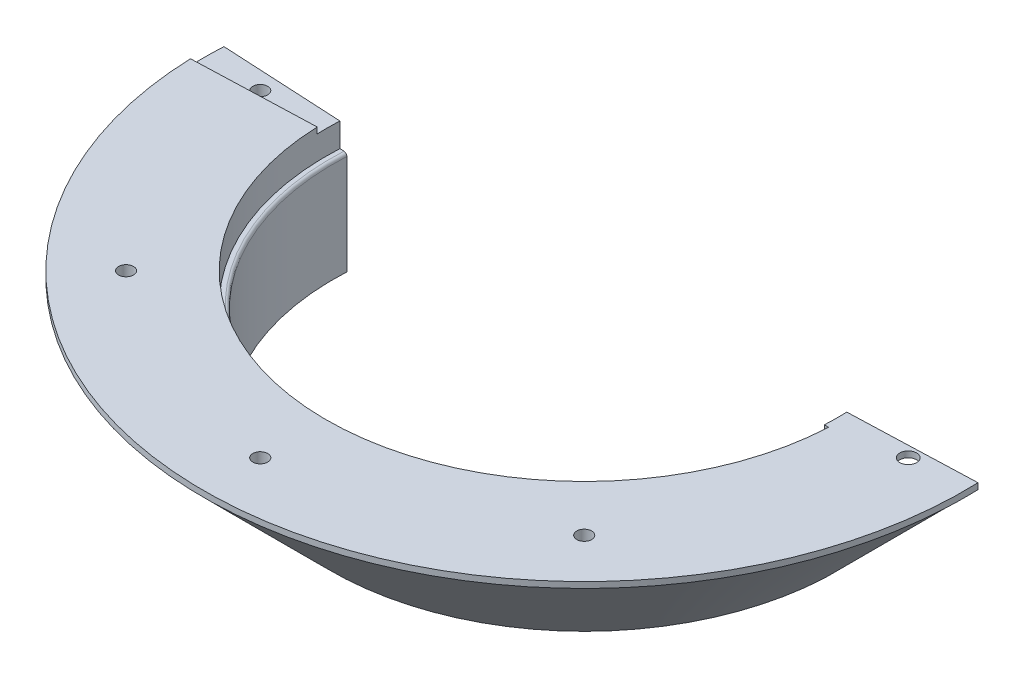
ISO-10303-21;
HEADER;
FILE_DESCRIPTION(('STEP AP214'),'2;1');
FILE_NAME('part.step','',(''),(''),'','','');
FILE_SCHEMA(('AUTOMOTIVE_DESIGN { 1 0 10303 214 1 1 1 1 }'));
ENDSEC;
DATA;
#1=APPLICATION_CONTEXT('core data for automotive mechanical design processes');
#2=APPLICATION_PROTOCOL_DEFINITION('international standard','automotive_design',2000,#1);
#3=PRODUCT_CONTEXT('',#1,'mechanical');
#4=PRODUCT('Part','Part','',(#3));
#5=PRODUCT_RELATED_PRODUCT_CATEGORY('part','',(#4));
#6=PRODUCT_DEFINITION_FORMATION('','',#4);
#7=PRODUCT_DEFINITION_CONTEXT('part definition',#1,'design');
#8=PRODUCT_DEFINITION('design','',#6,#7);
#9=PRODUCT_DEFINITION_SHAPE('','',#8);
#10=(LENGTH_UNIT() NAMED_UNIT(*) SI_UNIT(.MILLI.,.METRE.));
#11=(NAMED_UNIT(*) PLANE_ANGLE_UNIT() SI_UNIT($,.RADIAN.));
#12=(NAMED_UNIT(*) SI_UNIT($,.STERADIAN.) SOLID_ANGLE_UNIT());
#13=UNCERTAINTY_MEASURE_WITH_UNIT(LENGTH_MEASURE(1.E-05),#10,'distance_accuracy_value','');
#14=(GEOMETRIC_REPRESENTATION_CONTEXT(3) GLOBAL_UNCERTAINTY_ASSIGNED_CONTEXT((#13)) GLOBAL_UNIT_ASSIGNED_CONTEXT((#10,
#11,#12)) REPRESENTATION_CONTEXT('',''));
#15=CARTESIAN_POINT('',(0.,0.,0.));
#16=DIRECTION('',(0.,0.,1.));
#17=DIRECTION('',(1.,0.,0.));
#18=AXIS2_PLACEMENT_3D('',#15,#16,#17);
#19=CARTESIAN_POINT('',(-117.88380266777,18.796,0.));
#20=DIRECTION('',(0.,-1.,0.));
#21=DIRECTION('',(0.,0.,-1.));
#22=AXIS2_PLACEMENT_3D('',#19,#20,#21);
#23=PLANE('',#22);
#24=CARTESIAN_POINT('',(0.,18.796,0.));
#25=DIRECTION('',(0.,-1.,0.));
#26=DIRECTION('',(0.,0.,-1.));
#27=AXIS2_PLACEMENT_3D('',#24,#25,#26);
#28=CIRCLE('',#27,109.791499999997);
#29=CARTESIAN_POINT('',(109.641034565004,18.796,5.74604313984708));
#30=VERTEX_POINT('',#29);
#31=CARTESIAN_POINT('',(-109.724617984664,18.796,3.83166809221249));
#32=VERTEX_POINT('',#31);
#33=EDGE_CURVE('E192',#30,#32,#28,.T.);
#34=ORIENTED_EDGE('',*,*,#33,.T.);
#35=DIRECTION('',(0.999390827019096,0.,-0.0348994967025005));
#36=VECTOR('',#35,1.);
#37=CARTESIAN_POINT('',(-161.826359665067,18.796,5.6511010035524));
#38=LINE('',#37,#36);
#39=CARTESIAN_POINT('',(-161.826359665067,18.796,5.65110100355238));
#40=VERTEX_POINT('',#39);
#41=EDGE_CURVE('E187',#40,#32,#38,.T.);
#42=ORIENTED_EDGE('',*,*,#41,.F.);
#43=CARTESIAN_POINT('',(0.,18.796,0.));
#44=DIRECTION('',(0.,-1.,0.));
#45=DIRECTION('',(0.,0.,-1.));
#46=AXIS2_PLACEMENT_3D('',#43,#44,#45);
#47=CIRCLE('',#46,161.925);
#48=CARTESIAN_POINT('',(161.826359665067,18.796,-5.65110100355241));
#49=VERTEX_POINT('',#48);
#50=EDGE_CURVE('E180',#49,#40,#47,.T.);
#51=ORIENTED_EDGE('',*,*,#50,.F.);
#52=DIRECTION('',(-0.999390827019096,0.,0.0348994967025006));
#53=VECTOR('',#52,1.);
#54=CARTESIAN_POINT('',(107.896932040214,18.796,-3.76784389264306));
#55=LINE('',#54,#53);
#56=CARTESIAN_POINT('',(107.896932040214,18.796,-3.76784389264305));
#57=VERTEX_POINT('',#56);
#58=EDGE_CURVE('E186',#49,#57,#55,.T.);
#59=ORIENTED_EDGE('',*,*,#58,.T.);
#60=CARTESIAN_POINT('',(0.,18.796,0.));
#61=DIRECTION('',(0.,-1.,0.));
#62=DIRECTION('',(0.,0.,1.));
#63=AXIS2_PLACEMENT_3D('',#60,#61,#62);
#64=CIRCLE('',#63,107.9627);
#65=CARTESIAN_POINT('',(107.814740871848,18.796,5.65033114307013));
#66=VERTEX_POINT('',#65);
#67=EDGE_CURVE('E210',#57,#66,#64,.T.);
#68=ORIENTED_EDGE('',*,*,#67,.T.);
#69=DIRECTION('',(0.998629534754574,0.,0.0523359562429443));
#70=VECTOR('',#69,1.);
#71=CARTESIAN_POINT('',(107.814740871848,18.796,5.65033114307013));
#72=LINE('',#71,#70);
#73=EDGE_CURVE('E204',#66,#30,#72,.T.);
#74=ORIENTED_EDGE('',*,*,#73,.T.);
#75=EDGE_LOOP('',(#34,#42,#51,#59,#68,#74));
#76=FACE_BOUND('',#75,.T.);
#77=CARTESIAN_POINT('',(-97.4357789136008,18.796,97.4357789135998));
#78=DIRECTION('',(0.,1.,0.));
#79=DIRECTION('',(0.,0.,1.));
#80=AXIS2_PLACEMENT_3D('',#77,#78,#79);
#81=CIRCLE('',#80,3.175);
#82=CARTESIAN_POINT('',(-97.4357789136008,18.796,100.6107789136));
#83=VERTEX_POINT('',#82);
#84=EDGE_CURVE('E291',#83,#83,#81,.T.);
#85=ORIENTED_EDGE('',*,*,#84,.F.);
#86=EDGE_LOOP('',(#85));
#87=FACE_BOUND('',#86,.T.);
#88=CARTESIAN_POINT('',(-4.73459512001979E-13,18.796,137.795));
#89=DIRECTION('',(0.,1.,0.));
#90=DIRECTION('',(0.,0.,1.));
#91=AXIS2_PLACEMENT_3D('',#88,#89,#90);
#92=CIRCLE('',#91,3.17499999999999);
#93=CARTESIAN_POINT('',(-4.73459512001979E-13,18.796,140.97));
#94=VERTEX_POINT('',#93);
#95=EDGE_CURVE('E307',#94,#94,#92,.T.);
#96=ORIENTED_EDGE('',*,*,#95,.F.);
#97=EDGE_LOOP('',(#96));
#98=FACE_BOUND('',#97,.T.);
#99=CARTESIAN_POINT('',(97.4357789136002,18.796,97.4357789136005));
#100=DIRECTION('',(0.,1.,0.));
#101=DIRECTION('',(0.,0.,1.));
#102=AXIS2_PLACEMENT_3D('',#99,#100,#101);
#103=CIRCLE('',#102,3.175);
#104=CARTESIAN_POINT('',(97.4357789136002,18.796,100.610778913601));
#105=VERTEX_POINT('',#104);
#106=EDGE_CURVE('E323',#105,#105,#103,.T.);
#107=ORIENTED_EDGE('',*,*,#106,.F.);
#108=EDGE_LOOP('',(#107));
#109=FACE_BOUND('',#108,.T.);
#110=CARTESIAN_POINT('',(137.795,18.796,0.));
#111=DIRECTION('',(0.,1.,0.));
#112=DIRECTION('',(0.,0.,1.));
#113=AXIS2_PLACEMENT_3D('',#110,#111,#112);
#114=CIRCLE('',#113,3.57187499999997);
#115=CARTESIAN_POINT('',(137.795,18.796,3.57187499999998));
#116=VERTEX_POINT('',#115);
#117=EDGE_CURVE('E218',#116,#116,#114,.T.);
#118=ORIENTED_EDGE('',*,*,#117,.F.);
#119=EDGE_LOOP('',(#118));
#120=FACE_BOUND('',#119,.T.);
#121=ADVANCED_FACE('F44',(#76,#87,#98,#109,#120),#23,.F.);
#122=CARTESIAN_POINT('',(-161.703087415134,-37.7062999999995,-8.47449971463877));
#123=DIRECTION('',(0.0523359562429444,0.,-0.998629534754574));
#124=DIRECTION('',(-0.998629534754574,0.,-0.0523359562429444));
#125=AXIS2_PLACEMENT_3D('',#122,#123,#124);
#126=PLANE('',#125);
#127=DIRECTION('',(0.,-1.,0.));
#128=VECTOR('',#127,1.);
#129=CARTESIAN_POINT('',(109.641034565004,0.,5.74604313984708));
#130=LINE('',#129,#128);
#131=CARTESIAN_POINT('',(109.641034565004,6.09599999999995,5.74604313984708));
#132=VERTEX_POINT('',#131);
#133=CARTESIAN_POINT('',(109.641034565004,16.256,5.74604313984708));
#134=VERTEX_POINT('',#133);
#135=EDGE_CURVE('E266',#132,#134,#130,.F.);
#136=ORIENTED_EDGE('',*,*,#135,.T.);
#137=DIRECTION('',(-0.998629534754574,0.,-0.0523359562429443));
#138=VECTOR('',#137,1.);
#139=CARTESIAN_POINT('',(107.814740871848,16.256,5.65033114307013));
#140=LINE('',#139,#138);
#141=CARTESIAN_POINT('',(161.703087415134,16.256,8.47449971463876));
#142=VERTEX_POINT('',#141);
#143=EDGE_CURVE('E417',#142,#134,#140,.T.);
#144=ORIENTED_EDGE('',*,*,#143,.F.);
#145=DIRECTION('',(-0.70613771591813,-0.707106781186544,-0.0370071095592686));
#146=VECTOR('',#145,1.);
#147=CARTESIAN_POINT('',(0.,-145.668999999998,0.));
#148=LINE('',#147,#146);
#149=CARTESIAN_POINT('',(107.814740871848,-37.7062999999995,5.65033114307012));
#150=VERTEX_POINT('',#149);
#151=EDGE_CURVE('E272',#142,#150,#148,.T.);
#152=ORIENTED_EDGE('',*,*,#151,.T.);
#153=DIRECTION('',(-0.998629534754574,0.,-0.0523359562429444));
#154=VECTOR('',#153,1.);
#155=CARTESIAN_POINT('',(-161.703087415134,-37.7062999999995,-8.47449971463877));
#156=LINE('',#155,#154);
#157=CARTESIAN_POINT('',(106.546481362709,-37.7062999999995,5.58386447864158));
#158=VERTEX_POINT('',#157);
#159=EDGE_CURVE('E255',#150,#158,#156,.T.);
#160=ORIENTED_EDGE('',*,*,#159,.T.);
#161=DIRECTION('',(0.,-1.,0.));
#162=VECTOR('',#161,1.);
#163=CARTESIAN_POINT('',(106.546481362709,0.,5.58386447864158));
#164=LINE('',#163,#162);
#165=CARTESIAN_POINT('',(106.546481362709,4.82599999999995,5.58386447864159));
#166=VERTEX_POINT('',#165);
#167=EDGE_CURVE('E74',#158,#166,#164,.F.);
#168=ORIENTED_EDGE('',*,*,#167,.T.);
#169=CARTESIAN_POINT('',(107.814740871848,4.82599999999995,5.65033114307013));
#170=DIRECTION('',(0.0523359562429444,0.,-0.998629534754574));
#171=DIRECTION('',(-0.998629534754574,0.,-0.0523359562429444));
#172=AXIS2_PLACEMENT_3D('',#169,#170,#171);
#173=CIRCLE('',#172,1.27);
#174=CARTESIAN_POINT('',(107.814740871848,6.09599999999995,5.65033114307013));
#175=VERTEX_POINT('',#174);
#176=EDGE_CURVE('E367',#166,#175,#173,.T.);
#177=ORIENTED_EDGE('',*,*,#176,.T.);
#178=DIRECTION('',(0.998629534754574,0.,0.0523359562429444));
#179=VECTOR('',#178,1.);
#180=CARTESIAN_POINT('',(-109.49077533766,6.09599999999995,-5.7381683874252));
#181=LINE('',#180,#179);
#182=EDGE_CURVE('E260',#175,#132,#181,.T.);
#183=ORIENTED_EDGE('',*,*,#182,.T.);
#184=EDGE_LOOP('',(#136,#144,#152,#160,#168,#177,#183));
#185=FACE_BOUND('',#184,.T.);
#186=ADVANCED_FACE('F415',(#185),#126,.T.);
#187=DIRECTION('',(-0.70613771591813,0.707106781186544,-0.0370071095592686));
#188=VECTOR('',#187,1.);
#189=CARTESIAN_POINT('',(0.,-145.668999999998,0.));
#190=LINE('',#189,#188);
#191=CARTESIAN_POINT('',(-107.814740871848,-37.7062999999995,-5.65033114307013));
#192=VERTEX_POINT('',#191);
#193=CARTESIAN_POINT('',(-161.703087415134,16.256,-8.47449971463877));
#194=VERTEX_POINT('',#193);
#195=EDGE_CURVE('E275',#192,#194,#190,.T.);
#196=ORIENTED_EDGE('',*,*,#195,.T.);
#197=DIRECTION('',(0.998629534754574,0.,0.0523359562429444));
#198=VECTOR('',#197,1.);
#199=CARTESIAN_POINT('',(-161.703087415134,16.256,-8.47449971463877));
#200=LINE('',#199,#198);
#201=CARTESIAN_POINT('',(-109.641034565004,16.256,-5.74604313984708));
#202=VERTEX_POINT('',#201);
#203=EDGE_CURVE('E53',#194,#202,#200,.T.);
#204=ORIENTED_EDGE('',*,*,#203,.T.);
#205=DIRECTION('',(0.,-1.,0.));
#206=VECTOR('',#205,1.);
#207=CARTESIAN_POINT('',(-109.641034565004,0.,-5.74604313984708));
#208=LINE('',#207,#206);
#209=CARTESIAN_POINT('',(-109.641034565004,6.09599999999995,-5.74604313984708));
#210=VERTEX_POINT('',#209);
#211=EDGE_CURVE('E259',#202,#210,#208,.T.);
#212=ORIENTED_EDGE('',*,*,#211,.T.);
#213=CARTESIAN_POINT('',(-107.814740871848,6.09599999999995,-5.65033114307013));
#214=VERTEX_POINT('',#213);
#215=EDGE_CURVE('E256',#210,#214,#181,.T.);
#216=ORIENTED_EDGE('',*,*,#215,.T.);
#217=CARTESIAN_POINT('',(-107.814740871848,4.82599999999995,-5.65033114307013));
#218=DIRECTION('',(0.0523359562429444,0.,-0.998629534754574));
#219=DIRECTION('',(-0.998629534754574,0.,-0.0523359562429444));
#220=AXIS2_PLACEMENT_3D('',#217,#218,#219);
#221=CIRCLE('',#220,1.27);
#222=CARTESIAN_POINT('',(-106.546481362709,4.82599999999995,-5.58386447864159));
#223=VERTEX_POINT('',#222);
#224=EDGE_CURVE('E364',#214,#223,#221,.T.);
#225=ORIENTED_EDGE('',*,*,#224,.T.);
#226=DIRECTION('',(0.,-1.,0.));
#227=VECTOR('',#226,1.);
#228=CARTESIAN_POINT('',(-106.546481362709,0.,-5.58386447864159));
#229=LINE('',#228,#227);
#230=CARTESIAN_POINT('',(-106.546481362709,-37.7062999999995,-5.58386447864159));
#231=VERTEX_POINT('',#230);
#232=EDGE_CURVE('E263',#223,#231,#229,.T.);
#233=ORIENTED_EDGE('',*,*,#232,.T.);
#234=EDGE_CURVE('E252',#231,#192,#156,.T.);
#235=ORIENTED_EDGE('',*,*,#234,.T.);
#236=EDGE_LOOP('',(#196,#204,#212,#216,#225,#233,#235));
#237=FACE_BOUND('',#236,.T.);
#238=ADVANCED_FACE('F372',(#237),#126,.T.);
#239=CARTESIAN_POINT('',(0.,0.,0.));
#240=DIRECTION('',(0.,-1.,0.));
#241=DIRECTION('',(0.,0.,-1.));
#242=AXIS2_PLACEMENT_3D('',#239,#240,#241);
#243=CYLINDRICAL_SURFACE('',#242,106.6927);
#244=ORIENTED_EDGE('',*,*,#167,.F.);
#245=CARTESIAN_POINT('',(0.,-37.7062999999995,0.));
#246=DIRECTION('',(0.,-1.,0.));
#247=DIRECTION('',(0.,0.,-1.));
#248=AXIS2_PLACEMENT_3D('',#245,#246,#247);
#249=CIRCLE('',#248,106.6927);
#250=EDGE_CURVE('E339',#158,#231,#249,.T.);
#251=ORIENTED_EDGE('',*,*,#250,.T.);
#252=ORIENTED_EDGE('',*,*,#232,.F.);
#253=CARTESIAN_POINT('',(0.,4.82599999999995,0.));
#254=DIRECTION('',(0.,-1.,0.));
#255=DIRECTION('',(0.,0.,-1.));
#256=AXIS2_PLACEMENT_3D('',#253,#254,#255);
#257=CIRCLE('',#256,106.6927);
#258=EDGE_CURVE('E343',#166,#223,#257,.T.);
#259=ORIENTED_EDGE('',*,*,#258,.F.);
#260=EDGE_LOOP('',(#244,#251,#252,#259));
#261=FACE_BOUND('',#260,.T.);
#262=ADVANCED_FACE('F391',(#261),#243,.F.);
#263=CARTESIAN_POINT('',(-107.9627,-37.7062999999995,0.));
#264=DIRECTION('',(0.,1.,0.));
#265=DIRECTION('',(0.,0.,1.));
#266=AXIS2_PLACEMENT_3D('',#263,#264,#265);
#267=PLANE('',#266);
#268=ORIENTED_EDGE('',*,*,#159,.F.);
#269=CARTESIAN_POINT('',(0.,-37.7062999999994,0.));
#270=DIRECTION('',(0.,-1.,0.));
#271=DIRECTION('',(0.,0.,-1.));
#272=AXIS2_PLACEMENT_3D('',#269,#270,#271);
#273=CIRCLE('',#272,107.9627);
#274=EDGE_CURVE('E360',#150,#192,#273,.T.);
#275=ORIENTED_EDGE('',*,*,#274,.T.);
#276=ORIENTED_EDGE('',*,*,#234,.F.);
#277=ORIENTED_EDGE('',*,*,#250,.F.);
#278=EDGE_LOOP('',(#268,#275,#276,#277));
#279=FACE_BOUND('',#278,.T.);
#280=ADVANCED_FACE('F46',(#279),#267,.F.);
#281=CARTESIAN_POINT('',(0.,16.256,0.));
#282=DIRECTION('',(0.,1.,0.));
#283=DIRECTION('',(0.,0.,1.));
#284=AXIS2_PLACEMENT_3D('',#281,#282,#283);
#285=CONICAL_SURFACE('',#284,161.925,0.785398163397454);
#286=ORIENTED_EDGE('',*,*,#195,.F.);
#287=ORIENTED_EDGE('',*,*,#274,.F.);
#288=ORIENTED_EDGE('',*,*,#151,.F.);
#289=CARTESIAN_POINT('',(0.,16.256,0.));
#290=DIRECTION('',(0.,-1.,0.));
#291=DIRECTION('',(0.,0.,-1.));
#292=AXIS2_PLACEMENT_3D('',#289,#290,#291);
#293=CIRCLE('',#292,161.925);
#294=CARTESIAN_POINT('',(-161.826359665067,16.256,5.65110100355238));
#295=VERTEX_POINT('',#294);
#296=EDGE_CURVE('E191',#142,#295,#293,.T.);
#297=ORIENTED_EDGE('',*,*,#296,.T.);
#298=CARTESIAN_POINT('',(0.,16.256,0.));
#299=DIRECTION('',(0.,1.,0.));
#300=DIRECTION('',(0.,0.,1.));
#301=AXIS2_PLACEMENT_3D('',#298,#299,#300);
#302=CIRCLE('',#301,161.925);
#303=EDGE_CURVE('E235',#194,#295,#302,.T.);
#304=ORIENTED_EDGE('',*,*,#303,.F.);
#305=EDGE_LOOP('',(#286,#287,#288,#297,#304));
#306=FACE_BOUND('',#305,.T.);
#307=ADVANCED_FACE('F399',(#306),#285,.T.);
#308=CARTESIAN_POINT('',(0.,0.,0.));
#309=DIRECTION('',(0.,-1.,0.));
#310=DIRECTION('',(0.,0.,-1.));
#311=AXIS2_PLACEMENT_3D('',#308,#309,#310);
#312=CYLINDRICAL_SURFACE('',#311,161.925);
#313=ORIENTED_EDGE('',*,*,#50,.T.);
#314=DIRECTION('',(0.,1.,0.));
#315=VECTOR('',#314,1.);
#316=CARTESIAN_POINT('',(-161.826359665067,16.256,5.65110100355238));
#317=LINE('',#316,#315);
#318=EDGE_CURVE('E241',#295,#40,#317,.T.);
#319=ORIENTED_EDGE('',*,*,#318,.F.);
#320=ORIENTED_EDGE('',*,*,#296,.F.);
#321=CARTESIAN_POINT('',(0.,16.256,0.));
#322=DIRECTION('',(0.,1.,0.));
#323=DIRECTION('',(0.,0.,1.));
#324=AXIS2_PLACEMENT_3D('',#321,#322,#323);
#325=CIRCLE('',#324,161.925);
#326=CARTESIAN_POINT('',(161.826359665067,16.256,-5.65110100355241));
#327=VERTEX_POINT('',#326);
#328=EDGE_CURVE('E199',#327,#142,#325,.F.);
#329=ORIENTED_EDGE('',*,*,#328,.F.);
#330=DIRECTION('',(0.,1.,0.));
#331=VECTOR('',#330,1.);
#332=CARTESIAN_POINT('',(161.826359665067,-39.6676330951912,-5.65110100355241));
#333=LINE('',#332,#331);
#334=EDGE_CURVE('E196',#327,#49,#333,.T.);
#335=ORIENTED_EDGE('',*,*,#334,.T.);
#336=EDGE_LOOP('',(#313,#319,#320,#329,#335));
#337=FACE_BOUND('',#336,.T.);
#338=ADVANCED_FACE('F197',(#337),#312,.T.);
#339=CARTESIAN_POINT('',(0.,0.,0.));
#340=DIRECTION('',(0.,-1.,0.));
#341=DIRECTION('',(0.,0.,-1.));
#342=AXIS2_PLACEMENT_3D('',#339,#340,#341);
#343=CYLINDRICAL_SURFACE('',#342,109.791499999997);
#344=CARTESIAN_POINT('',(0.,16.256,0.));
#345=DIRECTION('',(0.,1.,0.));
#346=DIRECTION('',(0.,0.,1.));
#347=AXIS2_PLACEMENT_3D('',#344,#345,#346);
#348=CIRCLE('',#347,109.791499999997);
#349=CARTESIAN_POINT('',(-109.724617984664,16.256,3.83166809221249));
#350=VERTEX_POINT('',#349);
#351=EDGE_CURVE('E63',#350,#202,#348,.F.);
#352=ORIENTED_EDGE('',*,*,#351,.F.);
#353=DIRECTION('',(0.,-1.,0.));
#354=VECTOR('',#353,1.);
#355=CARTESIAN_POINT('',(-109.724617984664,0.,3.83166809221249));
#356=LINE('',#355,#354);
#357=EDGE_CURVE('E11',#350,#32,#356,.F.);
#358=ORIENTED_EDGE('',*,*,#357,.T.);
#359=ORIENTED_EDGE('',*,*,#33,.F.);
#360=EDGE_CURVE('E270',#134,#30,#130,.F.);
#361=ORIENTED_EDGE('',*,*,#360,.F.);
#362=ORIENTED_EDGE('',*,*,#135,.F.);
#363=CARTESIAN_POINT('',(0.,6.09599999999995,0.));
#364=DIRECTION('',(0.,-1.,0.));
#365=DIRECTION('',(0.,0.,-1.));
#366=AXIS2_PLACEMENT_3D('',#363,#364,#365);
#367=CIRCLE('',#366,109.791499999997);
#368=EDGE_CURVE('E351',#132,#210,#367,.T.);
#369=ORIENTED_EDGE('',*,*,#368,.T.);
#370=ORIENTED_EDGE('',*,*,#211,.F.);
#371=EDGE_LOOP('',(#352,#358,#359,#361,#362,#369,#370));
#372=FACE_BOUND('',#371,.T.);
#373=ADVANCED_FACE('F377',(#372),#343,.F.);
#374=CARTESIAN_POINT('',(-109.791499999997,6.09599999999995,0.));
#375=DIRECTION('',(0.,-1.,0.));
#376=DIRECTION('',(0.,0.,-1.));
#377=AXIS2_PLACEMENT_3D('',#374,#375,#376);
#378=PLANE('',#377);
#379=ORIENTED_EDGE('',*,*,#215,.F.);
#380=ORIENTED_EDGE('',*,*,#368,.F.);
#381=ORIENTED_EDGE('',*,*,#182,.F.);
#382=CARTESIAN_POINT('',(0.,6.09599999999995,0.));
#383=DIRECTION('',(0.,-1.,0.));
#384=DIRECTION('',(0.,0.,-1.));
#385=AXIS2_PLACEMENT_3D('',#382,#383,#384);
#386=CIRCLE('',#385,107.9627);
#387=EDGE_CURVE('E347',#175,#214,#386,.T.);
#388=ORIENTED_EDGE('',*,*,#387,.T.);
#389=EDGE_LOOP('',(#379,#380,#381,#388));
#390=FACE_BOUND('',#389,.T.);
#391=ADVANCED_FACE('F383',(#390),#378,.F.);
#392=CARTESIAN_POINT('',(0.,4.82599999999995,0.));
#393=DIRECTION('',(0.,-1.,0.));
#394=DIRECTION('',(0.,0.,-1.));
#395=AXIS2_PLACEMENT_3D('',#392,#393,#394);
#396=TOROIDAL_SURFACE('',#395,107.9627,1.27);
#397=ORIENTED_EDGE('',*,*,#176,.F.);
#398=ORIENTED_EDGE('',*,*,#258,.T.);
#399=ORIENTED_EDGE('',*,*,#224,.F.);
#400=ORIENTED_EDGE('',*,*,#387,.F.);
#401=EDGE_LOOP('',(#397,#398,#399,#400));
#402=FACE_BOUND('',#401,.T.);
#403=ADVANCED_FACE('F388',(#402),#396,.T.);
#404=CARTESIAN_POINT('',(97.4357789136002,2.28600000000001,97.4357789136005));
#405=DIRECTION('',(0.,1.,0.));
#406=DIRECTION('',(0.,0.,1.));
#407=AXIS2_PLACEMENT_3D('',#404,#405,#406);
#408=CONICAL_SURFACE('',#407,2.55269999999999,1.02974425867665);
#409=CARTESIAN_POINT('',(97.4357789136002,0.752183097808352,97.4357789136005));
#410=VERTEX_POINT('',#409);
#411=VERTEX_LOOP('',#410);
#412=FACE_BOUND('',#411,.T.);
#413=CARTESIAN_POINT('',(97.4357789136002,2.28600000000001,97.4357789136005));
#414=DIRECTION('',(0.,1.,0.));
#415=DIRECTION('',(0.,0.,1.));
#416=AXIS2_PLACEMENT_3D('',#413,#414,#415);
#417=CIRCLE('',#416,2.55269999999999);
#418=CARTESIAN_POINT('',(97.4357789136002,2.28600000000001,99.9884789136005));
#419=VERTEX_POINT('',#418);
#420=EDGE_CURVE('E335',#419,#419,#417,.T.);
#421=ORIENTED_EDGE('',*,*,#420,.T.);
#422=EDGE_LOOP('',(#421));
#423=FACE_BOUND('',#422,.T.);
#424=ADVANCED_FACE('F453',(#412,#423),#408,.F.);
#425=CARTESIAN_POINT('',(97.4357789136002,18.796,97.4357789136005));
#426=DIRECTION('',(0.,1.,0.));
#427=DIRECTION('',(0.,0.,1.));
#428=AXIS2_PLACEMENT_3D('',#425,#426,#427);
#429=CYLINDRICAL_SURFACE('',#428,2.55269999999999);
#430=ORIENTED_EDGE('',*,*,#420,.F.);
#431=EDGE_LOOP('',(#430));
#432=FACE_BOUND('',#431,.T.);
#433=CARTESIAN_POINT('',(97.4357789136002,6.09600000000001,97.4357789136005));
#434=DIRECTION('',(0.,1.,0.));
#435=DIRECTION('',(0.,0.,1.));
#436=AXIS2_PLACEMENT_3D('',#433,#434,#435);
#437=CIRCLE('',#436,2.55269999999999);
#438=CARTESIAN_POINT('',(97.4357789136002,6.09600000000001,99.9884789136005));
#439=VERTEX_POINT('',#438);
#440=EDGE_CURVE('E331',#439,#439,#437,.T.);
#441=ORIENTED_EDGE('',*,*,#440,.T.);
#442=EDGE_LOOP('',(#441));
#443=FACE_BOUND('',#442,.T.);
#444=ADVANCED_FACE('F591',(#432,#443),#429,.F.);
#445=CARTESIAN_POINT('',(99.9884789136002,6.09600000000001,97.4357789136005));
#446=DIRECTION('',(0.,-1.,0.));
#447=DIRECTION('',(0.,0.,-1.));
#448=AXIS2_PLACEMENT_3D('',#445,#446,#447);
#449=PLANE('',#448);
#450=ORIENTED_EDGE('',*,*,#440,.F.);
#451=EDGE_LOOP('',(#450));
#452=FACE_BOUND('',#451,.T.);
#453=CARTESIAN_POINT('',(97.4357789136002,6.09600000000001,97.4357789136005));
#454=DIRECTION('',(0.,1.,0.));
#455=DIRECTION('',(0.,0.,1.));
#456=AXIS2_PLACEMENT_3D('',#453,#454,#455);
#457=CIRCLE('',#456,3.175);
#458=CARTESIAN_POINT('',(97.4357789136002,6.09600000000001,100.610778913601));
#459=VERTEX_POINT('',#458);
#460=EDGE_CURVE('E327',#459,#459,#457,.T.);
#461=ORIENTED_EDGE('',*,*,#460,.T.);
#462=EDGE_LOOP('',(#461));
#463=FACE_BOUND('',#462,.T.);
#464=ADVANCED_FACE('F588',(#452,#463),#449,.F.);
#465=CARTESIAN_POINT('',(97.4357789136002,18.796,97.4357789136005));
#466=DIRECTION('',(0.,1.,0.));
#467=DIRECTION('',(0.,0.,1.));
#468=AXIS2_PLACEMENT_3D('',#465,#466,#467);
#469=CYLINDRICAL_SURFACE('',#468,3.175);
#470=ORIENTED_EDGE('',*,*,#460,.F.);
#471=EDGE_LOOP('',(#470));
#472=FACE_BOUND('',#471,.T.);
#473=ORIENTED_EDGE('',*,*,#106,.T.);
#474=EDGE_LOOP('',(#473));
#475=FACE_BOUND('',#474,.T.);
#476=ADVANCED_FACE('F584',(#472,#475),#469,.F.);
#477=CARTESIAN_POINT('',(-4.73459512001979E-13,2.28600000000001,137.795));
#478=DIRECTION('',(0.,1.,0.));
#479=DIRECTION('',(0.,0.,1.));
#480=AXIS2_PLACEMENT_3D('',#477,#478,#479);
#481=CONICAL_SURFACE('',#480,2.5527,1.02974425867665);
#482=CARTESIAN_POINT('',(-4.77878972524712E-13,0.752183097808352,137.795));
#483=VERTEX_POINT('',#482);
#484=VERTEX_LOOP('',#483);
#485=FACE_BOUND('',#484,.T.);
#486=CARTESIAN_POINT('',(-4.73459512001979E-13,2.28600000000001,137.795));
#487=DIRECTION('',(0.,1.,0.));
#488=DIRECTION('',(0.,0.,1.));
#489=AXIS2_PLACEMENT_3D('',#486,#487,#488);
#490=CIRCLE('',#489,2.5527);
#491=CARTESIAN_POINT('',(-4.73459512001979E-13,2.28600000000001,140.3477));
#492=VERTEX_POINT('',#491);
#493=EDGE_CURVE('E319',#492,#492,#490,.T.);
#494=ORIENTED_EDGE('',*,*,#493,.T.);
#495=EDGE_LOOP('',(#494));
#496=FACE_BOUND('',#495,.T.);
#497=ADVANCED_FACE('F580',(#485,#496),#481,.F.);
#498=CARTESIAN_POINT('',(-4.73459512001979E-13,18.796,137.795));
#499=DIRECTION('',(0.,1.,0.));
#500=DIRECTION('',(0.,0.,1.));
#501=AXIS2_PLACEMENT_3D('',#498,#499,#500);
#502=CYLINDRICAL_SURFACE('',#501,2.5527);
#503=ORIENTED_EDGE('',*,*,#493,.F.);
#504=EDGE_LOOP('',(#503));
#505=FACE_BOUND('',#504,.T.);
#506=CARTESIAN_POINT('',(-4.73459512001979E-13,6.09600000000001,137.795));
#507=DIRECTION('',(0.,1.,0.));
#508=DIRECTION('',(0.,0.,1.));
#509=AXIS2_PLACEMENT_3D('',#506,#507,#508);
#510=CIRCLE('',#509,2.5527);
#511=CARTESIAN_POINT('',(-4.73459512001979E-13,6.09600000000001,140.3477));
#512=VERTEX_POINT('',#511);
#513=EDGE_CURVE('E315',#512,#512,#510,.T.);
#514=ORIENTED_EDGE('',*,*,#513,.T.);
#515=EDGE_LOOP('',(#514));
#516=FACE_BOUND('',#515,.T.);
#517=ADVANCED_FACE('F576',(#505,#516),#502,.F.);
#518=CARTESIAN_POINT('',(2.55269999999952,6.09600000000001,137.795));
#519=DIRECTION('',(0.,-1.,0.));
#520=DIRECTION('',(0.,0.,-1.));
#521=AXIS2_PLACEMENT_3D('',#518,#519,#520);
#522=PLANE('',#521);
#523=ORIENTED_EDGE('',*,*,#513,.F.);
#524=EDGE_LOOP('',(#523));
#525=FACE_BOUND('',#524,.T.);
#526=CARTESIAN_POINT('',(-4.73459512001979E-13,6.09600000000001,137.795));
#527=DIRECTION('',(0.,1.,0.));
#528=DIRECTION('',(0.,0.,1.));
#529=AXIS2_PLACEMENT_3D('',#526,#527,#528);
#530=CIRCLE('',#529,3.175);
#531=CARTESIAN_POINT('',(-4.73459512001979E-13,6.09600000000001,140.97));
#532=VERTEX_POINT('',#531);
#533=EDGE_CURVE('E311',#532,#532,#530,.T.);
#534=ORIENTED_EDGE('',*,*,#533,.T.);
#535=EDGE_LOOP('',(#534));
#536=FACE_BOUND('',#535,.T.);
#537=ADVANCED_FACE('F572',(#525,#536),#522,.F.);
#538=CARTESIAN_POINT('',(-4.73459512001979E-13,18.796,137.795));
#539=DIRECTION('',(0.,1.,0.));
#540=DIRECTION('',(0.,0.,1.));
#541=AXIS2_PLACEMENT_3D('',#538,#539,#540);
#542=CYLINDRICAL_SURFACE('',#541,3.175);
#543=ORIENTED_EDGE('',*,*,#533,.F.);
#544=EDGE_LOOP('',(#543));
#545=FACE_BOUND('',#544,.T.);
#546=ORIENTED_EDGE('',*,*,#95,.T.);
#547=EDGE_LOOP('',(#546));
#548=FACE_BOUND('',#547,.T.);
#549=ADVANCED_FACE('F568',(#545,#548),#542,.F.);
#550=CARTESIAN_POINT('',(-97.4357789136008,2.28600000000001,97.4357789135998));
#551=DIRECTION('',(0.,1.,0.));
#552=DIRECTION('',(0.,0.,1.));
#553=AXIS2_PLACEMENT_3D('',#550,#551,#552);
#554=CONICAL_SURFACE('',#553,2.55269999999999,1.02974425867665);
#555=CARTESIAN_POINT('',(-97.4357789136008,0.752183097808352,97.4357789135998));
#556=VERTEX_POINT('',#555);
#557=VERTEX_LOOP('',#556);
#558=FACE_BOUND('',#557,.T.);
#559=CARTESIAN_POINT('',(-97.4357789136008,2.28600000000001,97.4357789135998));
#560=DIRECTION('',(0.,1.,0.));
#561=DIRECTION('',(0.,0.,1.));
#562=AXIS2_PLACEMENT_3D('',#559,#560,#561);
#563=CIRCLE('',#562,2.55269999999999);
#564=CARTESIAN_POINT('',(-97.4357789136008,2.28600000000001,99.9884789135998));
#565=VERTEX_POINT('',#564);
#566=EDGE_CURVE('E303',#565,#565,#563,.T.);
#567=ORIENTED_EDGE('',*,*,#566,.T.);
#568=EDGE_LOOP('',(#567));
#569=FACE_BOUND('',#568,.T.);
#570=ADVANCED_FACE('F564',(#558,#569),#554,.F.);
#571=CARTESIAN_POINT('',(-97.4357789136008,18.796,97.4357789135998));
#572=DIRECTION('',(0.,1.,0.));
#573=DIRECTION('',(0.,0.,1.));
#574=AXIS2_PLACEMENT_3D('',#571,#572,#573);
#575=CYLINDRICAL_SURFACE('',#574,2.55269999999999);
#576=ORIENTED_EDGE('',*,*,#566,.F.);
#577=EDGE_LOOP('',(#576));
#578=FACE_BOUND('',#577,.T.);
#579=CARTESIAN_POINT('',(-97.4357789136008,6.09600000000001,97.4357789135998));
#580=DIRECTION('',(0.,1.,0.));
#581=DIRECTION('',(0.,0.,1.));
#582=AXIS2_PLACEMENT_3D('',#579,#580,#581);
#583=CIRCLE('',#582,2.55269999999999);
#584=CARTESIAN_POINT('',(-97.4357789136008,6.09600000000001,99.9884789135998));
#585=VERTEX_POINT('',#584);
#586=EDGE_CURVE('E299',#585,#585,#583,.T.);
#587=ORIENTED_EDGE('',*,*,#586,.T.);
#588=EDGE_LOOP('',(#587));
#589=FACE_BOUND('',#588,.T.);
#590=ADVANCED_FACE('F560',(#578,#589),#575,.F.);
#591=CARTESIAN_POINT('',(-94.8830789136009,6.09600000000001,97.4357789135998));
#592=DIRECTION('',(0.,-1.,0.));
#593=DIRECTION('',(0.,0.,-1.));
#594=AXIS2_PLACEMENT_3D('',#591,#592,#593);
#595=PLANE('',#594);
#596=ORIENTED_EDGE('',*,*,#586,.F.);
#597=EDGE_LOOP('',(#596));
#598=FACE_BOUND('',#597,.T.);
#599=CARTESIAN_POINT('',(-97.4357789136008,6.09600000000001,97.4357789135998));
#600=DIRECTION('',(0.,1.,0.));
#601=DIRECTION('',(0.,0.,1.));
#602=AXIS2_PLACEMENT_3D('',#599,#600,#601);
#603=CIRCLE('',#602,3.175);
#604=CARTESIAN_POINT('',(-97.4357789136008,6.09600000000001,100.6107789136));
#605=VERTEX_POINT('',#604);
#606=EDGE_CURVE('E295',#605,#605,#603,.T.);
#607=ORIENTED_EDGE('',*,*,#606,.T.);
#608=EDGE_LOOP('',(#607));
#609=FACE_BOUND('',#608,.T.);
#610=ADVANCED_FACE('F556',(#598,#609),#595,.F.);
#611=CARTESIAN_POINT('',(-97.4357789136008,18.796,97.4357789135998));
#612=DIRECTION('',(0.,1.,0.));
#613=DIRECTION('',(0.,0.,1.));
#614=AXIS2_PLACEMENT_3D('',#611,#612,#613);
#615=CYLINDRICAL_SURFACE('',#614,3.175);
#616=ORIENTED_EDGE('',*,*,#606,.F.);
#617=EDGE_LOOP('',(#616));
#618=FACE_BOUND('',#617,.T.);
#619=ORIENTED_EDGE('',*,*,#84,.T.);
#620=EDGE_LOOP('',(#619));
#621=FACE_BOUND('',#620,.T.);
#622=ADVANCED_FACE('F539',(#618,#621),#615,.F.);
#623=CARTESIAN_POINT('',(-161.826359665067,16.256,5.6511010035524));
#624=DIRECTION('',(0.0348994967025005,0.,0.999390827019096));
#625=DIRECTION('',(0.999390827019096,0.,-0.0348994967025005));
#626=AXIS2_PLACEMENT_3D('',#623,#624,#625);
#627=PLANE('',#626);
#628=DIRECTION('',(0.999390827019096,0.,-0.0348994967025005));
#629=VECTOR('',#628,1.);
#630=CARTESIAN_POINT('',(-161.826359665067,16.256,5.6511010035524));
#631=LINE('',#630,#629);
#632=EDGE_CURVE('E238',#295,#350,#631,.T.);
#633=ORIENTED_EDGE('',*,*,#632,.F.);
#634=ORIENTED_EDGE('',*,*,#318,.T.);
#635=ORIENTED_EDGE('',*,*,#41,.T.);
#636=ORIENTED_EDGE('',*,*,#357,.F.);
#637=EDGE_LOOP('',(#633,#634,#635,#636));
#638=FACE_BOUND('',#637,.T.);
#639=ADVANCED_FACE('F403',(#638),#627,.F.);
#640=CARTESIAN_POINT('',(0.,16.256,0.));
#641=DIRECTION('',(0.,1.,0.));
#642=DIRECTION('',(0.,0.,1.));
#643=AXIS2_PLACEMENT_3D('',#640,#641,#642);
#644=PLANE('',#643);
#645=CARTESIAN_POINT('',(-137.795,16.256,0.));
#646=DIRECTION('',(0.,1.,0.));
#647=DIRECTION('',(0.,0.,1.));
#648=AXIS2_PLACEMENT_3D('',#645,#646,#647);
#649=CIRCLE('',#648,3.17499999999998);
#650=CARTESIAN_POINT('',(-137.795,16.256,3.17499999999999));
#651=VERTEX_POINT('',#650);
#652=EDGE_CURVE('E246',#651,#651,#649,.F.);
#653=ORIENTED_EDGE('',*,*,#652,.T.);
#654=EDGE_LOOP('',(#653));
#655=FACE_BOUND('',#654,.T.);
#656=ORIENTED_EDGE('',*,*,#351,.T.);
#657=ORIENTED_EDGE('',*,*,#203,.F.);
#658=ORIENTED_EDGE('',*,*,#303,.T.);
#659=ORIENTED_EDGE('',*,*,#632,.T.);
#660=EDGE_LOOP('',(#656,#657,#658,#659));
#661=FACE_BOUND('',#660,.T.);
#662=ADVANCED_FACE('F401',(#655,#661),#644,.T.);
#663=CARTESIAN_POINT('',(-137.795,2.28600000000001,0.));
#664=DIRECTION('',(0.,1.,0.));
#665=DIRECTION('',(0.,0.,1.));
#666=AXIS2_PLACEMENT_3D('',#663,#664,#665);
#667=CONICAL_SURFACE('',#666,2.55269999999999,1.02974425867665);
#668=CARTESIAN_POINT('',(-137.795,0.752183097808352,0.));
#669=VERTEX_POINT('',#668);
#670=VERTEX_LOOP('',#669);
#671=FACE_BOUND('',#670,.T.);
#672=CARTESIAN_POINT('',(-137.795,2.28600000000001,0.));
#673=DIRECTION('',(0.,1.,0.));
#674=DIRECTION('',(0.,0.,1.));
#675=AXIS2_PLACEMENT_3D('',#672,#673,#674);
#676=CIRCLE('',#675,2.55269999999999);
#677=CARTESIAN_POINT('',(-137.795,2.28600000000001,2.5527));
#678=VERTEX_POINT('',#677);
#679=EDGE_CURVE('E287',#678,#678,#676,.T.);
#680=ORIENTED_EDGE('',*,*,#679,.T.);
#681=EDGE_LOOP('',(#680));
#682=FACE_BOUND('',#681,.T.);
#683=ADVANCED_FACE('F536',(#671,#682),#667,.F.);
#684=CARTESIAN_POINT('',(-137.795,18.796,0.));
#685=DIRECTION('',(0.,1.,0.));
#686=DIRECTION('',(0.,0.,1.));
#687=AXIS2_PLACEMENT_3D('',#684,#685,#686);
#688=CYLINDRICAL_SURFACE('',#687,2.55269999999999);
#689=ORIENTED_EDGE('',*,*,#679,.F.);
#690=EDGE_LOOP('',(#689));
#691=FACE_BOUND('',#690,.T.);
#692=CARTESIAN_POINT('',(-137.795,6.09600000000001,0.));
#693=DIRECTION('',(0.,1.,0.));
#694=DIRECTION('',(0.,0.,1.));
#695=AXIS2_PLACEMENT_3D('',#692,#693,#694);
#696=CIRCLE('',#695,2.55269999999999);
#697=CARTESIAN_POINT('',(-137.795,6.09600000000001,2.5527));
#698=VERTEX_POINT('',#697);
#699=EDGE_CURVE('E283',#698,#698,#696,.T.);
#700=ORIENTED_EDGE('',*,*,#699,.T.);
#701=EDGE_LOOP('',(#700));
#702=FACE_BOUND('',#701,.T.);
#703=ADVANCED_FACE('F546',(#691,#702),#688,.F.);
#704=CARTESIAN_POINT('',(-135.2423,6.09600000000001,0.));
#705=DIRECTION('',(0.,-1.,0.));
#706=DIRECTION('',(0.,0.,-1.));
#707=AXIS2_PLACEMENT_3D('',#704,#705,#706);
#708=PLANE('',#707);
#709=ORIENTED_EDGE('',*,*,#699,.F.);
#710=EDGE_LOOP('',(#709));
#711=FACE_BOUND('',#710,.T.);
#712=CARTESIAN_POINT('',(-137.795,6.09600000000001,0.));
#713=DIRECTION('',(0.,1.,0.));
#714=DIRECTION('',(0.,0.,1.));
#715=AXIS2_PLACEMENT_3D('',#712,#713,#714);
#716=CIRCLE('',#715,3.17499999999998);
#717=CARTESIAN_POINT('',(-137.795,6.09600000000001,3.17499999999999));
#718=VERTEX_POINT('',#717);
#719=EDGE_CURVE('E279',#718,#718,#716,.T.);
#720=ORIENTED_EDGE('',*,*,#719,.T.);
#721=EDGE_LOOP('',(#720));
#722=FACE_BOUND('',#721,.T.);
#723=ADVANCED_FACE('F542',(#711,#722),#708,.F.);
#724=CARTESIAN_POINT('',(-137.795,18.796,0.));
#725=DIRECTION('',(0.,1.,0.));
#726=DIRECTION('',(0.,0.,1.));
#727=AXIS2_PLACEMENT_3D('',#724,#725,#726);
#728=CYLINDRICAL_SURFACE('',#727,3.17499999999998);
#729=ORIENTED_EDGE('',*,*,#719,.F.);
#730=EDGE_LOOP('',(#729));
#731=FACE_BOUND('',#730,.T.);
#732=ORIENTED_EDGE('',*,*,#652,.F.);
#733=EDGE_LOOP('',(#732));
#734=FACE_BOUND('',#733,.T.);
#735=ADVANCED_FACE('F486',(#731,#734),#728,.F.);
#736=CARTESIAN_POINT('',(107.814740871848,-39.6676330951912,5.65033114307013));
#737=DIRECTION('',(-0.0523359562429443,0.,0.998629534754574));
#738=DIRECTION('',(0.998629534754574,0.,0.0523359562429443));
#739=AXIS2_PLACEMENT_3D('',#736,#737,#738);
#740=PLANE('',#739);
#741=ORIENTED_EDGE('',*,*,#360,.T.);
#742=ORIENTED_EDGE('',*,*,#73,.F.);
#743=DIRECTION('',(0.,1.,0.));
#744=VECTOR('',#743,1.);
#745=CARTESIAN_POINT('',(107.814740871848,-39.6676330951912,5.65033114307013));
#746=LINE('',#745,#744);
#747=CARTESIAN_POINT('',(107.814740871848,16.256,5.65033114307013));
#748=VERTEX_POINT('',#747);
#749=EDGE_CURVE('E226',#748,#66,#746,.T.);
#750=ORIENTED_EDGE('',*,*,#749,.F.);
#751=EDGE_CURVE('E409',#134,#748,#140,.T.);
#752=ORIENTED_EDGE('',*,*,#751,.F.);
#753=EDGE_LOOP('',(#741,#742,#750,#752));
#754=FACE_BOUND('',#753,.T.);
#755=ADVANCED_FACE('F408',(#754),#740,.T.);
#756=CARTESIAN_POINT('',(0.,-39.6676330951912,0.));
#757=DIRECTION('',(0.,1.,0.));
#758=DIRECTION('',(0.,0.,1.));
#759=AXIS2_PLACEMENT_3D('',#756,#757,#758);
#760=CYLINDRICAL_SURFACE('',#759,107.9627);
#761=CARTESIAN_POINT('',(0.,16.256,0.));
#762=DIRECTION('',(0.,1.,0.));
#763=DIRECTION('',(0.,0.,1.));
#764=AXIS2_PLACEMENT_3D('',#761,#762,#763);
#765=CIRCLE('',#764,107.9627);
#766=CARTESIAN_POINT('',(107.896932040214,16.256,-3.76784389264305));
#767=VERTEX_POINT('',#766);
#768=EDGE_CURVE('E229',#748,#767,#765,.T.);
#769=ORIENTED_EDGE('',*,*,#768,.F.);
#770=ORIENTED_EDGE('',*,*,#749,.T.);
#771=ORIENTED_EDGE('',*,*,#67,.F.);
#772=DIRECTION('',(0.,1.,0.));
#773=VECTOR('',#772,1.);
#774=CARTESIAN_POINT('',(107.896932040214,-39.6676330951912,-3.76784389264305));
#775=LINE('',#774,#773);
#776=EDGE_CURVE('E203',#767,#57,#775,.T.);
#777=ORIENTED_EDGE('',*,*,#776,.F.);
#778=EDGE_LOOP('',(#769,#770,#771,#777));
#779=FACE_BOUND('',#778,.T.);
#780=ADVANCED_FACE('F485',(#779),#760,.F.);
#781=CARTESIAN_POINT('',(107.896932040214,-39.6676330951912,-3.76784389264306));
#782=DIRECTION('',(-0.0348994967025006,0.,-0.999390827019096));
#783=DIRECTION('',(-0.999390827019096,0.,0.0348994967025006));
#784=AXIS2_PLACEMENT_3D('',#781,#782,#783);
#785=PLANE('',#784);
#786=DIRECTION('',(0.999390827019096,0.,-0.0348994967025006));
#787=VECTOR('',#786,1.);
#788=CARTESIAN_POINT('',(107.896932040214,16.256,-3.76784389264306));
#789=LINE('',#788,#787);
#790=EDGE_CURVE('E232',#767,#327,#789,.T.);
#791=ORIENTED_EDGE('',*,*,#790,.F.);
#792=ORIENTED_EDGE('',*,*,#776,.T.);
#793=ORIENTED_EDGE('',*,*,#58,.F.);
#794=ORIENTED_EDGE('',*,*,#334,.F.);
#795=EDGE_LOOP('',(#791,#792,#793,#794));
#796=FACE_BOUND('',#795,.T.);
#797=ADVANCED_FACE('F206',(#796),#785,.T.);
#798=CARTESIAN_POINT('',(0.,16.256,0.));
#799=DIRECTION('',(0.,1.,0.));
#800=DIRECTION('',(0.,0.,1.));
#801=AXIS2_PLACEMENT_3D('',#798,#799,#800);
#802=PLANE('',#801);
#803=CARTESIAN_POINT('',(137.795,16.256,0.));
#804=DIRECTION('',(0.,1.,0.));
#805=DIRECTION('',(0.,0.,1.));
#806=AXIS2_PLACEMENT_3D('',#803,#804,#805);
#807=CIRCLE('',#806,3.57187499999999);
#808=CARTESIAN_POINT('',(137.795,16.256,3.571875));
#809=VERTEX_POINT('',#808);
#810=EDGE_CURVE('E211',#809,#809,#807,.T.);
#811=ORIENTED_EDGE('',*,*,#810,.T.);
#812=EDGE_LOOP('',(#811));
#813=FACE_BOUND('',#812,.T.);
#814=ORIENTED_EDGE('',*,*,#328,.T.);
#815=ORIENTED_EDGE('',*,*,#143,.T.);
#816=ORIENTED_EDGE('',*,*,#751,.T.);
#817=ORIENTED_EDGE('',*,*,#768,.T.);
#818=ORIENTED_EDGE('',*,*,#790,.T.);
#819=EDGE_LOOP('',(#814,#815,#816,#817,#818));
#820=FACE_BOUND('',#819,.T.);
#821=ADVANCED_FACE('F505',(#813,#820),#802,.F.);
#822=CARTESIAN_POINT('',(137.795,18.796,0.));
#823=DIRECTION('',(0.,1.,0.));
#824=DIRECTION('',(0.,0.,1.));
#825=AXIS2_PLACEMENT_3D('',#822,#823,#824);
#826=CYLINDRICAL_SURFACE('',#825,3.57187499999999);
#827=ORIENTED_EDGE('',*,*,#117,.T.);
#828=EDGE_LOOP('',(#827));
#829=FACE_BOUND('',#828,.T.);
#830=ORIENTED_EDGE('',*,*,#810,.F.);
#831=EDGE_LOOP('',(#830));
#832=FACE_BOUND('',#831,.T.);
#833=ADVANCED_FACE('F427',(#829,#832),#826,.F.);
#834=CLOSED_SHELL('',(#121,#186,#238,#262,#280,#307,#338,#373,#391,#403,#424,#444,#464,#476,
#497,#517,#537,#549,#570,#590,#610,#622,#639,#662,#683,#703,#723,#735,#755,#780,#797,#821,#833));
#835=MANIFOLD_SOLID_BREP('B2',#834);
#836=ADVANCED_BREP_SHAPE_REPRESENTATION('',(#18,#835),#14);
#837=SHAPE_DEFINITION_REPRESENTATION(#9,#836);
ENDSEC;
END-ISO-10303-21;
